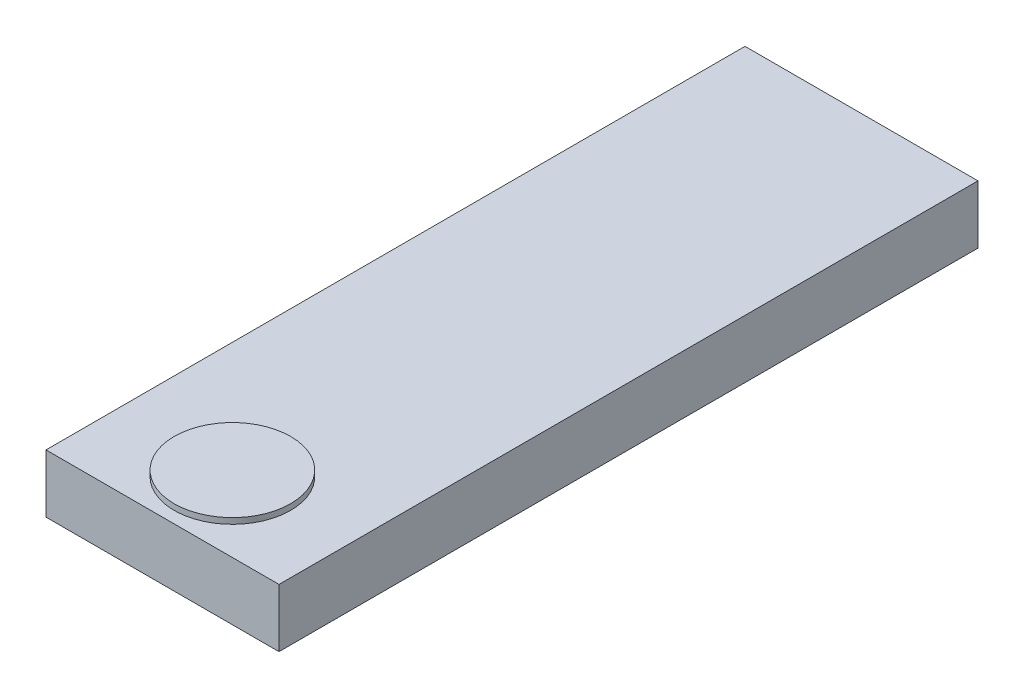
ISO-10303-21;
HEADER;
FILE_DESCRIPTION(('STEP AP214'),'2;1');
FILE_NAME('part.step','',(''),(''),'','','');
FILE_SCHEMA(('AUTOMOTIVE_DESIGN { 1 0 10303 214 1 1 1 1 }'));
ENDSEC;
DATA;
#1=APPLICATION_CONTEXT('core data for automotive mechanical design processes');
#2=APPLICATION_PROTOCOL_DEFINITION('international standard','automotive_design',2000,#1);
#3=PRODUCT_CONTEXT('',#1,'mechanical');
#4=PRODUCT('Part','Part','',(#3));
#5=PRODUCT_RELATED_PRODUCT_CATEGORY('part','',(#4));
#6=PRODUCT_DEFINITION_FORMATION('','',#4);
#7=PRODUCT_DEFINITION_CONTEXT('part definition',#1,'design');
#8=PRODUCT_DEFINITION('design','',#6,#7);
#9=PRODUCT_DEFINITION_SHAPE('','',#8);
#10=(LENGTH_UNIT() NAMED_UNIT(*) SI_UNIT(.MILLI.,.METRE.));
#11=(NAMED_UNIT(*) PLANE_ANGLE_UNIT() SI_UNIT($,.RADIAN.));
#12=(NAMED_UNIT(*) SI_UNIT($,.STERADIAN.) SOLID_ANGLE_UNIT());
#13=UNCERTAINTY_MEASURE_WITH_UNIT(LENGTH_MEASURE(1.E-05),#10,'distance_accuracy_value','');
#14=(GEOMETRIC_REPRESENTATION_CONTEXT(3) GLOBAL_UNCERTAINTY_ASSIGNED_CONTEXT((#13)) GLOBAL_UNIT_ASSIGNED_CONTEXT((#10,
#11,#12)) REPRESENTATION_CONTEXT('',''));
#15=CARTESIAN_POINT('',(0.,0.,0.));
#16=DIRECTION('',(0.,0.,1.));
#17=DIRECTION('',(1.,0.,0.));
#18=AXIS2_PLACEMENT_3D('',#15,#16,#17);
#19=CARTESIAN_POINT('',(-25.4,0.,152.4));
#20=DIRECTION('',(1.,0.,0.));
#21=DIRECTION('',(0.,1.,0.));
#22=AXIS2_PLACEMENT_3D('',#19,#20,#21);
#23=PLANE('',#22);
#24=DIRECTION('',(0.,-1.,0.));
#25=VECTOR('',#24,1.);
#26=CARTESIAN_POINT('',(-25.4,0.,0.));
#27=LINE('',#26,#25);
#28=CARTESIAN_POINT('',(-25.4,0.,0.));
#29=VERTEX_POINT('',#28);
#30=CARTESIAN_POINT('',(-25.4,-12.7,0.));
#31=VERTEX_POINT('',#30);
#32=EDGE_CURVE('E99',#29,#31,#27,.T.);
#33=ORIENTED_EDGE('',*,*,#32,.T.);
#34=DIRECTION('',(0.,0.,-1.));
#35=VECTOR('',#34,1.);
#36=CARTESIAN_POINT('',(-25.4,-12.7,152.4));
#37=LINE('',#36,#35);
#38=CARTESIAN_POINT('',(-25.4,-12.7,152.4));
#39=VERTEX_POINT('',#38);
#40=EDGE_CURVE('E41',#39,#31,#37,.T.);
#41=ORIENTED_EDGE('',*,*,#40,.F.);
#42=DIRECTION('',(0.,-1.,0.));
#43=VECTOR('',#42,1.);
#44=CARTESIAN_POINT('',(-25.4,0.,152.4));
#45=LINE('',#44,#43);
#46=CARTESIAN_POINT('',(-25.4,0.,152.4));
#47=VERTEX_POINT('',#46);
#48=EDGE_CURVE('E85',#47,#39,#45,.T.);
#49=ORIENTED_EDGE('',*,*,#48,.F.);
#50=DIRECTION('',(0.,0.,-1.));
#51=VECTOR('',#50,1.);
#52=CARTESIAN_POINT('',(-25.4,0.,152.4));
#53=LINE('',#52,#51);
#54=EDGE_CURVE('E95',#47,#29,#53,.T.);
#55=ORIENTED_EDGE('',*,*,#54,.T.);
#56=EDGE_LOOP('',(#33,#41,#49,#55));
#57=FACE_BOUND('',#56,.T.);
#58=ADVANCED_FACE('F33',(#57),#23,.F.);
#59=CARTESIAN_POINT('',(-25.4,-12.7,152.4));
#60=DIRECTION('',(0.,1.,0.));
#61=DIRECTION('',(0.,0.,1.));
#62=AXIS2_PLACEMENT_3D('',#59,#60,#61);
#63=PLANE('',#62);
#64=DIRECTION('',(1.,0.,0.));
#65=VECTOR('',#64,1.);
#66=CARTESIAN_POINT('',(-25.4,-12.7,0.));
#67=LINE('',#66,#65);
#68=CARTESIAN_POINT('',(25.4,-12.7,0.));
#69=VERTEX_POINT('',#68);
#70=EDGE_CURVE('E90',#31,#69,#67,.T.);
#71=ORIENTED_EDGE('',*,*,#70,.T.);
#72=DIRECTION('',(0.,0.,-1.));
#73=VECTOR('',#72,1.);
#74=CARTESIAN_POINT('',(25.4,-12.7,152.4));
#75=LINE('',#74,#73);
#76=CARTESIAN_POINT('',(25.4,-12.7,152.4));
#77=VERTEX_POINT('',#76);
#78=EDGE_CURVE('E88',#77,#69,#75,.T.);
#79=ORIENTED_EDGE('',*,*,#78,.F.);
#80=DIRECTION('',(1.,0.,0.));
#81=VECTOR('',#80,1.);
#82=CARTESIAN_POINT('',(-25.4,-12.7,152.4));
#83=LINE('',#82,#81);
#84=EDGE_CURVE('E80',#39,#77,#83,.T.);
#85=ORIENTED_EDGE('',*,*,#84,.F.);
#86=ORIENTED_EDGE('',*,*,#40,.T.);
#87=EDGE_LOOP('',(#71,#79,#85,#86));
#88=FACE_BOUND('',#87,.T.);
#89=ADVANCED_FACE('F89',(#88),#63,.F.);
#90=CARTESIAN_POINT('',(25.4,0.,152.4));
#91=DIRECTION('',(-1.,0.,0.));
#92=DIRECTION('',(0.,-1.,0.));
#93=AXIS2_PLACEMENT_3D('',#90,#91,#92);
#94=PLANE('',#93);
#95=DIRECTION('',(0.,1.,0.));
#96=VECTOR('',#95,1.);
#97=CARTESIAN_POINT('',(25.4,0.,0.));
#98=LINE('',#97,#96);
#99=CARTESIAN_POINT('',(25.4,0.,0.));
#100=VERTEX_POINT('',#99);
#101=EDGE_CURVE('E66',#69,#100,#98,.T.);
#102=ORIENTED_EDGE('',*,*,#101,.T.);
#103=DIRECTION('',(0.,0.,-1.));
#104=VECTOR('',#103,1.);
#105=CARTESIAN_POINT('',(25.4,0.,152.4));
#106=LINE('',#105,#104);
#107=CARTESIAN_POINT('',(25.4,0.,152.4));
#108=VERTEX_POINT('',#107);
#109=EDGE_CURVE('E91',#108,#100,#106,.T.);
#110=ORIENTED_EDGE('',*,*,#109,.F.);
#111=DIRECTION('',(0.,1.,0.));
#112=VECTOR('',#111,1.);
#113=CARTESIAN_POINT('',(25.4,0.,152.4));
#114=LINE('',#113,#112);
#115=EDGE_CURVE('E83',#77,#108,#114,.T.);
#116=ORIENTED_EDGE('',*,*,#115,.F.);
#117=ORIENTED_EDGE('',*,*,#78,.T.);
#118=EDGE_LOOP('',(#102,#110,#116,#117));
#119=FACE_BOUND('',#118,.T.);
#120=ADVANCED_FACE('F93',(#119),#94,.F.);
#121=CARTESIAN_POINT('',(-25.4,0.,152.4));
#122=DIRECTION('',(0.,-1.,0.));
#123=DIRECTION('',(0.,0.,-1.));
#124=AXIS2_PLACEMENT_3D('',#121,#122,#123);
#125=PLANE('',#124);
#126=CARTESIAN_POINT('',(0.,0.,137.16));
#127=DIRECTION('',(0.,-1.,0.));
#128=DIRECTION('',(0.,0.,-1.));
#129=AXIS2_PLACEMENT_3D('',#126,#127,#128);
#130=CIRCLE('',#129,12.7);
#131=CARTESIAN_POINT('',(0.,0.,124.46));
#132=VERTEX_POINT('',#131);
#133=EDGE_CURVE('E11',#132,#132,#130,.F.);
#134=ORIENTED_EDGE('',*,*,#133,.F.);
#135=EDGE_LOOP('',(#134));
#136=FACE_BOUND('',#135,.T.);
#137=DIRECTION('',(-1.,0.,0.));
#138=VECTOR('',#137,1.);
#139=CARTESIAN_POINT('',(-25.4,0.,0.));
#140=LINE('',#139,#138);
#141=EDGE_CURVE('E72',#100,#29,#140,.T.);
#142=ORIENTED_EDGE('',*,*,#141,.T.);
#143=ORIENTED_EDGE('',*,*,#54,.F.);
#144=DIRECTION('',(-1.,0.,0.));
#145=VECTOR('',#144,1.);
#146=CARTESIAN_POINT('',(-25.4,0.,152.4));
#147=LINE('',#146,#145);
#148=EDGE_CURVE('E49',#108,#47,#147,.T.);
#149=ORIENTED_EDGE('',*,*,#148,.F.);
#150=ORIENTED_EDGE('',*,*,#109,.T.);
#151=EDGE_LOOP('',(#142,#143,#149,#150));
#152=FACE_BOUND('',#151,.T.);
#153=ADVANCED_FACE('F121',(#136,#152),#125,.F.);
#154=CARTESIAN_POINT('',(0.,0.,152.4));
#155=DIRECTION('',(0.,0.,1.));
#156=DIRECTION('',(1.,0.,0.));
#157=AXIS2_PLACEMENT_3D('',#154,#155,#156);
#158=PLANE('',#157);
#159=ORIENTED_EDGE('',*,*,#48,.T.);
#160=ORIENTED_EDGE('',*,*,#84,.T.);
#161=ORIENTED_EDGE('',*,*,#115,.T.);
#162=ORIENTED_EDGE('',*,*,#148,.T.);
#163=EDGE_LOOP('',(#159,#160,#161,#162));
#164=FACE_BOUND('',#163,.T.);
#165=ADVANCED_FACE('F81',(#164),#158,.T.);
#166=CARTESIAN_POINT('',(0.,0.,0.));
#167=DIRECTION('',(0.,0.,1.));
#168=DIRECTION('',(1.,0.,0.));
#169=AXIS2_PLACEMENT_3D('',#166,#167,#168);
#170=PLANE('',#169);
#171=ORIENTED_EDGE('',*,*,#32,.F.);
#172=ORIENTED_EDGE('',*,*,#141,.F.);
#173=ORIENTED_EDGE('',*,*,#101,.F.);
#174=ORIENTED_EDGE('',*,*,#70,.F.);
#175=EDGE_LOOP('',(#171,#172,#173,#174));
#176=FACE_BOUND('',#175,.T.);
#177=ADVANCED_FACE('F110',(#176),#170,.F.);
#178=CARTESIAN_POINT('',(0.,1.27,137.16));
#179=DIRECTION('',(0.,-1.,0.));
#180=DIRECTION('',(0.,0.,-1.));
#181=AXIS2_PLACEMENT_3D('',#178,#179,#180);
#182=CYLINDRICAL_SURFACE('',#181,12.7);
#183=CARTESIAN_POINT('',(0.,1.27,137.16));
#184=DIRECTION('',(0.,1.,0.));
#185=DIRECTION('',(0.,0.,1.));
#186=AXIS2_PLACEMENT_3D('',#183,#184,#185);
#187=CIRCLE('',#186,12.7);
#188=CARTESIAN_POINT('',(0.,1.27,149.86));
#189=VERTEX_POINT('',#188);
#190=EDGE_CURVE('E102',#189,#189,#187,.T.);
#191=ORIENTED_EDGE('',*,*,#190,.F.);
#192=EDGE_LOOP('',(#191));
#193=FACE_BOUND('',#192,.T.);
#194=ORIENTED_EDGE('',*,*,#133,.T.);
#195=EDGE_LOOP('',(#194));
#196=FACE_BOUND('',#195,.T.);
#197=ADVANCED_FACE('F112',(#193,#196),#182,.T.);
#198=CARTESIAN_POINT('',(0.,1.27,137.16));
#199=DIRECTION('',(0.,1.,0.));
#200=DIRECTION('',(0.,0.,1.));
#201=AXIS2_PLACEMENT_3D('',#198,#199,#200);
#202=PLANE('',#201);
#203=ORIENTED_EDGE('',*,*,#190,.T.);
#204=EDGE_LOOP('',(#203));
#205=FACE_BOUND('',#204,.T.);
#206=ADVANCED_FACE('F118',(#205),#202,.T.);
#207=CLOSED_SHELL('',(#58,#89,#120,#153,#165,#177,#197,#206));
#208=MANIFOLD_SOLID_BREP('B2',#207);
#209=ADVANCED_BREP_SHAPE_REPRESENTATION('',(#18,#208),#14);
#210=SHAPE_DEFINITION_REPRESENTATION(#9,#209);
ENDSEC;
END-ISO-10303-21;
